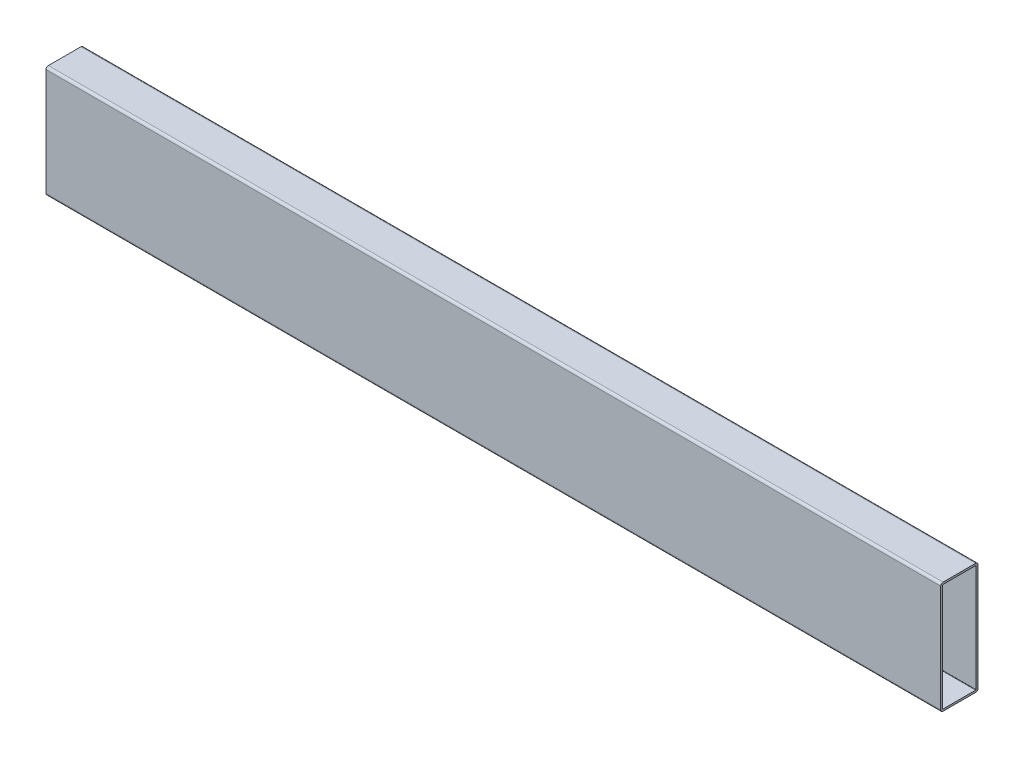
ISO-10303-21;
HEADER;
FILE_DESCRIPTION(('STEP AP214'),'2;1');
FILE_NAME('part.step','',(''),(''),'','','');
FILE_SCHEMA(('AUTOMOTIVE_DESIGN { 1 0 10303 214 1 1 1 1 }'));
ENDSEC;
DATA;
#1=APPLICATION_CONTEXT('core data for automotive mechanical design processes');
#2=APPLICATION_PROTOCOL_DEFINITION('international standard','automotive_design',2000,#1);
#3=PRODUCT_CONTEXT('',#1,'mechanical');
#4=PRODUCT('Part','Part','',(#3));
#5=PRODUCT_RELATED_PRODUCT_CATEGORY('part','',(#4));
#6=PRODUCT_DEFINITION_FORMATION('','',#4);
#7=PRODUCT_DEFINITION_CONTEXT('part definition',#1,'design');
#8=PRODUCT_DEFINITION('design','',#6,#7);
#9=PRODUCT_DEFINITION_SHAPE('','',#8);
#10=(LENGTH_UNIT() NAMED_UNIT(*) SI_UNIT(.MILLI.,.METRE.));
#11=(NAMED_UNIT(*) PLANE_ANGLE_UNIT() SI_UNIT($,.RADIAN.));
#12=(NAMED_UNIT(*) SI_UNIT($,.STERADIAN.) SOLID_ANGLE_UNIT());
#13=UNCERTAINTY_MEASURE_WITH_UNIT(LENGTH_MEASURE(1.E-05),#10,'distance_accuracy_value','');
#14=(GEOMETRIC_REPRESENTATION_CONTEXT(3) GLOBAL_UNCERTAINTY_ASSIGNED_CONTEXT((#13)) GLOBAL_UNIT_ASSIGNED_CONTEXT((#10,
#11,#12)) REPRESENTATION_CONTEXT('',''));
#15=CARTESIAN_POINT('',(0.,0.,0.));
#16=DIRECTION('',(0.,0.,1.));
#17=DIRECTION('',(1.,0.,0.));
#18=AXIS2_PLACEMENT_3D('',#15,#16,#17);
#19=CARTESIAN_POINT('',(609.6,3.65674086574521,-16.8519621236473));
#20=DIRECTION('',(-1.,0.,0.));
#21=DIRECTION('',(0.,0.,1.));
#22=AXIS2_PLACEMENT_3D('',#19,#20,#21);
#23=PLANE('',#22);
#24=CARTESIAN_POINT('',(609.6,3.65674086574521,-16.8519621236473));
#25=DIRECTION('',(1.,0.,0.));
#26=DIRECTION('',(0.,0.,1.));
#27=AXIS2_PLACEMENT_3D('',#24,#25,#26);
#28=CIRCLE('',#27,1.5875);
#29=CARTESIAN_POINT('',(609.6,3.6567408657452,-18.4394621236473));
#30=VERTEX_POINT('',#29);
#31=CARTESIAN_POINT('',(609.6,5.24424086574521,-16.8519621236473));
#32=VERTEX_POINT('',#31);
#33=EDGE_CURVE('E211',#30,#32,#28,.T.);
#34=ORIENTED_EDGE('',*,*,#33,.T.);
#35=DIRECTION('',(0.,0.,1.));
#36=VECTOR('',#35,1.);
#37=CARTESIAN_POINT('',(609.6,5.24424086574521,5.37303787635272));
#38=LINE('',#37,#36);
#39=CARTESIAN_POINT('',(609.6,5.24424086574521,5.37303787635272));
#40=VERTEX_POINT('',#39);
#41=EDGE_CURVE('E214',#32,#40,#38,.T.);
#42=ORIENTED_EDGE('',*,*,#41,.T.);
#43=CARTESIAN_POINT('',(609.6,3.65674086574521,5.37303787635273));
#44=DIRECTION('',(1.,0.,0.));
#45=DIRECTION('',(0.,0.,1.));
#46=AXIS2_PLACEMENT_3D('',#43,#44,#45);
#47=CIRCLE('',#46,1.5875);
#48=CARTESIAN_POINT('',(609.6,3.6567408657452,6.96053787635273));
#49=VERTEX_POINT('',#48);
#50=EDGE_CURVE('E217',#40,#49,#47,.T.);
#51=ORIENTED_EDGE('',*,*,#50,.T.);
#52=DIRECTION('',(0.,-1.,0.));
#53=VECTOR('',#52,1.);
#54=CARTESIAN_POINT('',(609.6,3.6567408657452,6.96053787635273));
#55=LINE('',#54,#53);
#56=CARTESIAN_POINT('',(609.6,-69.3682591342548,6.96053787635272));
#57=VERTEX_POINT('',#56);
#58=EDGE_CURVE('E219',#49,#57,#55,.T.);
#59=ORIENTED_EDGE('',*,*,#58,.T.);
#60=CARTESIAN_POINT('',(609.6,-69.3682591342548,5.37303787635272));
#61=DIRECTION('',(1.,0.,0.));
#62=DIRECTION('',(0.,0.,1.));
#63=AXIS2_PLACEMENT_3D('',#60,#61,#62);
#64=CIRCLE('',#63,1.5875);
#65=CARTESIAN_POINT('',(609.6,-70.9557591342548,5.37303787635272));
#66=VERTEX_POINT('',#65);
#67=EDGE_CURVE('E221',#57,#66,#64,.T.);
#68=ORIENTED_EDGE('',*,*,#67,.T.);
#69=DIRECTION('',(0.,0.,-1.));
#70=VECTOR('',#69,1.);
#71=CARTESIAN_POINT('',(609.6,-70.9557591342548,5.37303787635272));
#72=LINE('',#71,#70);
#73=CARTESIAN_POINT('',(609.6,-70.9557591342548,-16.8519621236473));
#74=VERTEX_POINT('',#73);
#75=EDGE_CURVE('E223',#66,#74,#72,.T.);
#76=ORIENTED_EDGE('',*,*,#75,.T.);
#77=CARTESIAN_POINT('',(609.6,-69.3682591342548,-16.8519621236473));
#78=DIRECTION('',(1.,0.,0.));
#79=DIRECTION('',(0.,0.,1.));
#80=AXIS2_PLACEMENT_3D('',#77,#78,#79);
#81=CIRCLE('',#80,1.5875);
#82=CARTESIAN_POINT('',(609.6,-69.3682591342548,-18.4394621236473));
#83=VERTEX_POINT('',#82);
#84=EDGE_CURVE('E225',#74,#83,#81,.T.);
#85=ORIENTED_EDGE('',*,*,#84,.T.);
#86=DIRECTION('',(0.,1.,0.));
#87=VECTOR('',#86,1.);
#88=CARTESIAN_POINT('',(609.6,3.6567408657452,-18.4394621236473));
#89=LINE('',#88,#87);
#90=EDGE_CURVE('E227',#83,#30,#89,.T.);
#91=ORIENTED_EDGE('',*,*,#90,.T.);
#92=EDGE_LOOP('',(#34,#42,#51,#59,#68,#76,#85,#91));
#93=FACE_BOUND('',#92,.T.);
#94=CARTESIAN_POINT('',(609.6,3.65674086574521,5.37303787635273));
#95=DIRECTION('',(1.,0.,0.));
#96=DIRECTION('',(0.,0.,1.));
#97=AXIS2_PLACEMENT_3D('',#94,#95,#96);
#98=CIRCLE('',#97,0.2413);
#99=CARTESIAN_POINT('',(609.6,3.89804086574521,5.37303787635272));
#100=VERTEX_POINT('',#99);
#101=CARTESIAN_POINT('',(609.6,3.6567408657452,5.61433787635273));
#102=VERTEX_POINT('',#101);
#103=EDGE_CURVE('E146',#100,#102,#98,.T.);
#104=ORIENTED_EDGE('',*,*,#103,.F.);
#105=DIRECTION('',(0.,0.,1.));
#106=VECTOR('',#105,1.);
#107=CARTESIAN_POINT('',(609.6,3.89804086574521,5.37303787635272));
#108=LINE('',#107,#106);
#109=CARTESIAN_POINT('',(609.6,3.89804086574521,-16.8519621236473));
#110=VERTEX_POINT('',#109);
#111=EDGE_CURVE('E179',#110,#100,#108,.T.);
#112=ORIENTED_EDGE('',*,*,#111,.F.);
#113=CARTESIAN_POINT('',(609.6,3.65674086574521,-16.8519621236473));
#114=DIRECTION('',(1.,0.,0.));
#115=DIRECTION('',(0.,0.,1.));
#116=AXIS2_PLACEMENT_3D('',#113,#114,#115);
#117=CIRCLE('',#116,0.2413);
#118=CARTESIAN_POINT('',(609.6,3.65674086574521,-17.0932621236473));
#119=VERTEX_POINT('',#118);
#120=EDGE_CURVE('E177',#119,#110,#117,.T.);
#121=ORIENTED_EDGE('',*,*,#120,.F.);
#122=DIRECTION('',(0.,1.,0.));
#123=VECTOR('',#122,1.);
#124=CARTESIAN_POINT('',(609.6,3.65674086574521,-17.0932621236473));
#125=LINE('',#124,#123);
#126=CARTESIAN_POINT('',(609.6,-69.3682591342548,-17.0932621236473));
#127=VERTEX_POINT('',#126);
#128=EDGE_CURVE('E175',#127,#119,#125,.T.);
#129=ORIENTED_EDGE('',*,*,#128,.F.);
#130=CARTESIAN_POINT('',(609.6,-69.3682591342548,-16.8519621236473));
#131=DIRECTION('',(1.,0.,0.));
#132=DIRECTION('',(0.,0.,1.));
#133=AXIS2_PLACEMENT_3D('',#130,#131,#132);
#134=CIRCLE('',#133,0.2413);
#135=CARTESIAN_POINT('',(609.6,-69.6095591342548,-16.8519621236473));
#136=VERTEX_POINT('',#135);
#137=EDGE_CURVE('E173',#136,#127,#134,.T.);
#138=ORIENTED_EDGE('',*,*,#137,.F.);
#139=DIRECTION('',(0.,0.,-1.));
#140=VECTOR('',#139,1.);
#141=CARTESIAN_POINT('',(609.6,-69.6095591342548,5.37303787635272));
#142=LINE('',#141,#140);
#143=CARTESIAN_POINT('',(609.6,-69.6095591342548,5.37303787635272));
#144=VERTEX_POINT('',#143);
#145=EDGE_CURVE('E169',#144,#136,#142,.T.);
#146=ORIENTED_EDGE('',*,*,#145,.F.);
#147=CARTESIAN_POINT('',(609.6,-69.3682591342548,5.37303787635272));
#148=DIRECTION('',(1.,0.,0.));
#149=DIRECTION('',(0.,0.,1.));
#150=AXIS2_PLACEMENT_3D('',#147,#148,#149);
#151=CIRCLE('',#150,0.2413);
#152=CARTESIAN_POINT('',(609.6,-69.3682591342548,5.61433787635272));
#153=VERTEX_POINT('',#152);
#154=EDGE_CURVE('E167',#153,#144,#151,.T.);
#155=ORIENTED_EDGE('',*,*,#154,.F.);
#156=DIRECTION('',(0.,-1.,0.));
#157=VECTOR('',#156,1.);
#158=CARTESIAN_POINT('',(609.6,3.6567408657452,5.61433787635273));
#159=LINE('',#158,#157);
#160=EDGE_CURVE('E154',#102,#153,#159,.T.);
#161=ORIENTED_EDGE('',*,*,#160,.F.);
#162=EDGE_LOOP('',(#104,#112,#121,#129,#138,#146,#155,#161));
#163=FACE_BOUND('',#162,.T.);
#164=ADVANCED_FACE('F33',(#93,#163),#23,.F.);
#165=CARTESIAN_POINT('',(0.,3.65674086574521,-16.8519621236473));
#166=DIRECTION('',(-1.,0.,0.));
#167=DIRECTION('',(0.,0.,1.));
#168=AXIS2_PLACEMENT_3D('',#165,#166,#167);
#169=PLANE('',#168);
#170=CARTESIAN_POINT('',(0.,3.65674086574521,-16.8519621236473));
#171=DIRECTION('',(1.,0.,0.));
#172=DIRECTION('',(0.,0.,1.));
#173=AXIS2_PLACEMENT_3D('',#170,#171,#172);
#174=CIRCLE('',#173,1.5875);
#175=CARTESIAN_POINT('',(0.,3.6567408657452,-18.4394621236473));
#176=VERTEX_POINT('',#175);
#177=CARTESIAN_POINT('',(0.,5.24424086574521,-16.8519621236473));
#178=VERTEX_POINT('',#177);
#179=EDGE_CURVE('E162',#176,#178,#174,.T.);
#180=ORIENTED_EDGE('',*,*,#179,.F.);
#181=DIRECTION('',(0.,1.,0.));
#182=VECTOR('',#181,1.);
#183=CARTESIAN_POINT('',(0.,3.6567408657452,-18.4394621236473));
#184=LINE('',#183,#182);
#185=CARTESIAN_POINT('',(0.,-69.3682591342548,-18.4394621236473));
#186=VERTEX_POINT('',#185);
#187=EDGE_CURVE('E215',#186,#176,#184,.T.);
#188=ORIENTED_EDGE('',*,*,#187,.F.);
#189=CARTESIAN_POINT('',(0.,-69.3682591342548,-16.8519621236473));
#190=DIRECTION('',(1.,0.,0.));
#191=DIRECTION('',(0.,0.,1.));
#192=AXIS2_PLACEMENT_3D('',#189,#190,#191);
#193=CIRCLE('',#192,1.5875);
#194=CARTESIAN_POINT('',(0.,-70.9557591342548,-16.8519621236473));
#195=VERTEX_POINT('',#194);
#196=EDGE_CURVE('E242',#195,#186,#193,.T.);
#197=ORIENTED_EDGE('',*,*,#196,.F.);
#198=DIRECTION('',(0.,0.,-1.));
#199=VECTOR('',#198,1.);
#200=CARTESIAN_POINT('',(0.,-70.9557591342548,5.37303787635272));
#201=LINE('',#200,#199);
#202=CARTESIAN_POINT('',(0.,-70.9557591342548,5.37303787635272));
#203=VERTEX_POINT('',#202);
#204=EDGE_CURVE('E240',#203,#195,#201,.T.);
#205=ORIENTED_EDGE('',*,*,#204,.F.);
#206=CARTESIAN_POINT('',(0.,-69.3682591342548,5.37303787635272));
#207=DIRECTION('',(1.,0.,0.));
#208=DIRECTION('',(0.,0.,1.));
#209=AXIS2_PLACEMENT_3D('',#206,#207,#208);
#210=CIRCLE('',#209,1.5875);
#211=CARTESIAN_POINT('',(0.,-69.3682591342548,6.96053787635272));
#212=VERTEX_POINT('',#211);
#213=EDGE_CURVE('E238',#212,#203,#210,.T.);
#214=ORIENTED_EDGE('',*,*,#213,.F.);
#215=DIRECTION('',(0.,-1.,0.));
#216=VECTOR('',#215,1.);
#217=CARTESIAN_POINT('',(0.,3.6567408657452,6.96053787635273));
#218=LINE('',#217,#216);
#219=CARTESIAN_POINT('',(0.,3.6567408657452,6.96053787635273));
#220=VERTEX_POINT('',#219);
#221=EDGE_CURVE('E236',#220,#212,#218,.T.);
#222=ORIENTED_EDGE('',*,*,#221,.F.);
#223=CARTESIAN_POINT('',(0.,3.65674086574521,5.37303787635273));
#224=DIRECTION('',(1.,0.,0.));
#225=DIRECTION('',(0.,0.,1.));
#226=AXIS2_PLACEMENT_3D('',#223,#224,#225);
#227=CIRCLE('',#226,1.5875);
#228=CARTESIAN_POINT('',(0.,5.24424086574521,5.37303787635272));
#229=VERTEX_POINT('',#228);
#230=EDGE_CURVE('E234',#229,#220,#227,.T.);
#231=ORIENTED_EDGE('',*,*,#230,.F.);
#232=DIRECTION('',(0.,0.,1.));
#233=VECTOR('',#232,1.);
#234=CARTESIAN_POINT('',(0.,5.24424086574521,5.37303787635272));
#235=LINE('',#234,#233);
#236=EDGE_CURVE('E232',#178,#229,#235,.T.);
#237=ORIENTED_EDGE('',*,*,#236,.F.);
#238=EDGE_LOOP('',(#180,#188,#197,#205,#214,#222,#231,#237));
#239=FACE_BOUND('',#238,.T.);
#240=DIRECTION('',(0.,0.,1.));
#241=VECTOR('',#240,1.);
#242=CARTESIAN_POINT('',(0.,3.89804086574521,5.37303787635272));
#243=LINE('',#242,#241);
#244=CARTESIAN_POINT('',(0.,3.89804086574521,-16.8519621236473));
#245=VERTEX_POINT('',#244);
#246=CARTESIAN_POINT('',(0.,3.89804086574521,5.37303787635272));
#247=VERTEX_POINT('',#246);
#248=EDGE_CURVE('E155',#245,#247,#243,.T.);
#249=ORIENTED_EDGE('',*,*,#248,.T.);
#250=CARTESIAN_POINT('',(0.,3.65674086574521,5.37303787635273));
#251=DIRECTION('',(1.,0.,0.));
#252=DIRECTION('',(0.,0.,1.));
#253=AXIS2_PLACEMENT_3D('',#250,#251,#252);
#254=CIRCLE('',#253,0.2413);
#255=CARTESIAN_POINT('',(0.,3.6567408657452,5.61433787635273));
#256=VERTEX_POINT('',#255);
#257=EDGE_CURVE('E56',#247,#256,#254,.T.);
#258=ORIENTED_EDGE('',*,*,#257,.T.);
#259=DIRECTION('',(0.,-1.,0.));
#260=VECTOR('',#259,1.);
#261=CARTESIAN_POINT('',(0.,3.6567408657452,5.61433787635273));
#262=LINE('',#261,#260);
#263=CARTESIAN_POINT('',(0.,-69.3682591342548,5.61433787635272));
#264=VERTEX_POINT('',#263);
#265=EDGE_CURVE('E161',#256,#264,#262,.T.);
#266=ORIENTED_EDGE('',*,*,#265,.T.);
#267=CARTESIAN_POINT('',(0.,-69.3682591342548,5.37303787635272));
#268=DIRECTION('',(1.,0.,0.));
#269=DIRECTION('',(0.,0.,1.));
#270=AXIS2_PLACEMENT_3D('',#267,#268,#269);
#271=CIRCLE('',#270,0.2413);
#272=CARTESIAN_POINT('',(0.,-69.6095591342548,5.37303787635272));
#273=VERTEX_POINT('',#272);
#274=EDGE_CURVE('E183',#264,#273,#271,.T.);
#275=ORIENTED_EDGE('',*,*,#274,.T.);
#276=DIRECTION('',(0.,0.,-1.));
#277=VECTOR('',#276,1.);
#278=CARTESIAN_POINT('',(0.,-69.6095591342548,5.37303787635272));
#279=LINE('',#278,#277);
#280=CARTESIAN_POINT('',(0.,-69.6095591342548,-16.8519621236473));
#281=VERTEX_POINT('',#280);
#282=EDGE_CURVE('E186',#273,#281,#279,.T.);
#283=ORIENTED_EDGE('',*,*,#282,.T.);
#284=CARTESIAN_POINT('',(0.,-69.3682591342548,-16.8519621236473));
#285=DIRECTION('',(1.,0.,0.));
#286=DIRECTION('',(0.,0.,1.));
#287=AXIS2_PLACEMENT_3D('',#284,#285,#286);
#288=CIRCLE('',#287,0.2413);
#289=CARTESIAN_POINT('',(0.,-69.3682591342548,-17.0932621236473));
#290=VERTEX_POINT('',#289);
#291=EDGE_CURVE('E189',#281,#290,#288,.T.);
#292=ORIENTED_EDGE('',*,*,#291,.T.);
#293=DIRECTION('',(0.,1.,0.));
#294=VECTOR('',#293,1.);
#295=CARTESIAN_POINT('',(0.,3.65674086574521,-17.0932621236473));
#296=LINE('',#295,#294);
#297=CARTESIAN_POINT('',(0.,3.65674086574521,-17.0932621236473));
#298=VERTEX_POINT('',#297);
#299=EDGE_CURVE('E192',#290,#298,#296,.T.);
#300=ORIENTED_EDGE('',*,*,#299,.T.);
#301=CARTESIAN_POINT('',(0.,3.65674086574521,-16.8519621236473));
#302=DIRECTION('',(1.,0.,0.));
#303=DIRECTION('',(0.,0.,1.));
#304=AXIS2_PLACEMENT_3D('',#301,#302,#303);
#305=CIRCLE('',#304,0.2413);
#306=EDGE_CURVE('E195',#298,#245,#305,.T.);
#307=ORIENTED_EDGE('',*,*,#306,.T.);
#308=EDGE_LOOP('',(#249,#258,#266,#275,#283,#292,#300,#307));
#309=FACE_BOUND('',#308,.T.);
#310=ADVANCED_FACE('F272',(#239,#309),#169,.T.);
#311=CARTESIAN_POINT('',(609.6,3.65674086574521,-16.8519621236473));
#312=DIRECTION('',(-1.,0.,0.));
#313=DIRECTION('',(0.,0.,1.));
#314=AXIS2_PLACEMENT_3D('',#311,#312,#313);
#315=CYLINDRICAL_SURFACE('',#314,1.5875);
#316=ORIENTED_EDGE('',*,*,#179,.T.);
#317=DIRECTION('',(-1.,0.,0.));
#318=VECTOR('',#317,1.);
#319=CARTESIAN_POINT('',(609.6,5.24424086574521,-16.8519621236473));
#320=LINE('',#319,#318);
#321=EDGE_CURVE('E11',#32,#178,#320,.T.);
#322=ORIENTED_EDGE('',*,*,#321,.F.);
#323=ORIENTED_EDGE('',*,*,#33,.F.);
#324=DIRECTION('',(-1.,0.,0.));
#325=VECTOR('',#324,1.);
#326=CARTESIAN_POINT('',(609.6,3.6567408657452,-18.4394621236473));
#327=LINE('',#326,#325);
#328=EDGE_CURVE('E229',#30,#176,#327,.T.);
#329=ORIENTED_EDGE('',*,*,#328,.T.);
#330=EDGE_LOOP('',(#316,#322,#323,#329));
#331=FACE_BOUND('',#330,.T.);
#332=ADVANCED_FACE('F35',(#331),#315,.T.);
#333=CARTESIAN_POINT('',(609.6,5.24424086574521,5.37303787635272));
#334=DIRECTION('',(0.,-1.,0.));
#335=DIRECTION('',(0.,0.,-1.));
#336=AXIS2_PLACEMENT_3D('',#333,#334,#335);
#337=PLANE('',#336);
#338=ORIENTED_EDGE('',*,*,#236,.T.);
#339=DIRECTION('',(-1.,0.,0.));
#340=VECTOR('',#339,1.);
#341=CARTESIAN_POINT('',(609.6,5.24424086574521,5.37303787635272));
#342=LINE('',#341,#340);
#343=EDGE_CURVE('E41',#40,#229,#342,.T.);
#344=ORIENTED_EDGE('',*,*,#343,.F.);
#345=ORIENTED_EDGE('',*,*,#41,.F.);
#346=ORIENTED_EDGE('',*,*,#321,.T.);
#347=EDGE_LOOP('',(#338,#344,#345,#346));
#348=FACE_BOUND('',#347,.T.);
#349=ADVANCED_FACE('F289',(#348),#337,.F.);
#350=CARTESIAN_POINT('',(609.6,3.65674086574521,5.37303787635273));
#351=DIRECTION('',(-1.,0.,0.));
#352=DIRECTION('',(0.,0.,1.));
#353=AXIS2_PLACEMENT_3D('',#350,#351,#352);
#354=CYLINDRICAL_SURFACE('',#353,1.5875);
#355=ORIENTED_EDGE('',*,*,#230,.T.);
#356=DIRECTION('',(-1.,0.,0.));
#357=VECTOR('',#356,1.);
#358=CARTESIAN_POINT('',(609.6,3.6567408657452,6.96053787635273));
#359=LINE('',#358,#357);
#360=EDGE_CURVE('E259',#49,#220,#359,.T.);
#361=ORIENTED_EDGE('',*,*,#360,.F.);
#362=ORIENTED_EDGE('',*,*,#50,.F.);
#363=ORIENTED_EDGE('',*,*,#343,.T.);
#364=EDGE_LOOP('',(#355,#361,#362,#363));
#365=FACE_BOUND('',#364,.T.);
#366=ADVANCED_FACE('F266',(#365),#354,.T.);
#367=CARTESIAN_POINT('',(609.6,3.6567408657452,6.96053787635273));
#368=DIRECTION('',(0.,0.,-1.));
#369=DIRECTION('',(0.,1.,0.));
#370=AXIS2_PLACEMENT_3D('',#367,#368,#369);
#371=PLANE('',#370);
#372=ORIENTED_EDGE('',*,*,#221,.T.);
#373=DIRECTION('',(-1.,0.,0.));
#374=VECTOR('',#373,1.);
#375=CARTESIAN_POINT('',(609.6,-69.3682591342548,6.96053787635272));
#376=LINE('',#375,#374);
#377=EDGE_CURVE('E256',#57,#212,#376,.T.);
#378=ORIENTED_EDGE('',*,*,#377,.F.);
#379=ORIENTED_EDGE('',*,*,#58,.F.);
#380=ORIENTED_EDGE('',*,*,#360,.T.);
#381=EDGE_LOOP('',(#372,#378,#379,#380));
#382=FACE_BOUND('',#381,.T.);
#383=ADVANCED_FACE('F278',(#382),#371,.F.);
#384=CARTESIAN_POINT('',(609.6,-69.3682591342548,5.37303787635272));
#385=DIRECTION('',(-1.,0.,0.));
#386=DIRECTION('',(0.,0.,1.));
#387=AXIS2_PLACEMENT_3D('',#384,#385,#386);
#388=CYLINDRICAL_SURFACE('',#387,1.5875);
#389=ORIENTED_EDGE('',*,*,#213,.T.);
#390=DIRECTION('',(-1.,0.,0.));
#391=VECTOR('',#390,1.);
#392=CARTESIAN_POINT('',(609.6,-70.9557591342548,5.37303787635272));
#393=LINE('',#392,#391);
#394=EDGE_CURVE('E253',#66,#203,#393,.T.);
#395=ORIENTED_EDGE('',*,*,#394,.F.);
#396=ORIENTED_EDGE('',*,*,#67,.F.);
#397=ORIENTED_EDGE('',*,*,#377,.T.);
#398=EDGE_LOOP('',(#389,#395,#396,#397));
#399=FACE_BOUND('',#398,.T.);
#400=ADVANCED_FACE('F282',(#399),#388,.T.);
#401=CARTESIAN_POINT('',(609.6,-70.9557591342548,5.37303787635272));
#402=DIRECTION('',(0.,1.,0.));
#403=DIRECTION('',(0.,0.,1.));
#404=AXIS2_PLACEMENT_3D('',#401,#402,#403);
#405=PLANE('',#404);
#406=ORIENTED_EDGE('',*,*,#204,.T.);
#407=DIRECTION('',(-1.,0.,0.));
#408=VECTOR('',#407,1.);
#409=CARTESIAN_POINT('',(609.6,-70.9557591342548,-16.8519621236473));
#410=LINE('',#409,#408);
#411=EDGE_CURVE('E250',#74,#195,#410,.T.);
#412=ORIENTED_EDGE('',*,*,#411,.F.);
#413=ORIENTED_EDGE('',*,*,#75,.F.);
#414=ORIENTED_EDGE('',*,*,#394,.T.);
#415=EDGE_LOOP('',(#406,#412,#413,#414));
#416=FACE_BOUND('',#415,.T.);
#417=ADVANCED_FACE('F302',(#416),#405,.F.);
#418=CARTESIAN_POINT('',(609.6,-69.3682591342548,-16.8519621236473));
#419=DIRECTION('',(-1.,0.,0.));
#420=DIRECTION('',(0.,0.,1.));
#421=AXIS2_PLACEMENT_3D('',#418,#419,#420);
#422=CYLINDRICAL_SURFACE('',#421,1.5875);
#423=ORIENTED_EDGE('',*,*,#196,.T.);
#424=DIRECTION('',(-1.,0.,0.));
#425=VECTOR('',#424,1.);
#426=CARTESIAN_POINT('',(609.6,-69.3682591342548,-18.4394621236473));
#427=LINE('',#426,#425);
#428=EDGE_CURVE('E247',#83,#186,#427,.T.);
#429=ORIENTED_EDGE('',*,*,#428,.F.);
#430=ORIENTED_EDGE('',*,*,#84,.F.);
#431=ORIENTED_EDGE('',*,*,#411,.T.);
#432=EDGE_LOOP('',(#423,#429,#430,#431));
#433=FACE_BOUND('',#432,.T.);
#434=ADVANCED_FACE('F300',(#433),#422,.T.);
#435=CARTESIAN_POINT('',(609.6,3.6567408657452,-18.4394621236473));
#436=DIRECTION('',(0.,0.,1.));
#437=DIRECTION('',(0.,-1.,0.));
#438=AXIS2_PLACEMENT_3D('',#435,#436,#437);
#439=PLANE('',#438);
#440=ORIENTED_EDGE('',*,*,#187,.T.);
#441=ORIENTED_EDGE('',*,*,#328,.F.);
#442=ORIENTED_EDGE('',*,*,#90,.F.);
#443=ORIENTED_EDGE('',*,*,#428,.T.);
#444=EDGE_LOOP('',(#440,#441,#442,#443));
#445=FACE_BOUND('',#444,.T.);
#446=ADVANCED_FACE('F295',(#445),#439,.F.);
#447=CARTESIAN_POINT('',(609.6,3.65674086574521,5.37303787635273));
#448=DIRECTION('',(-1.,0.,0.));
#449=DIRECTION('',(0.,0.,1.));
#450=AXIS2_PLACEMENT_3D('',#447,#448,#449);
#451=CYLINDRICAL_SURFACE('',#450,0.2413);
#452=ORIENTED_EDGE('',*,*,#257,.F.);
#453=DIRECTION('',(-1.,0.,0.));
#454=VECTOR('',#453,1.);
#455=CARTESIAN_POINT('',(609.6,3.89804086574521,5.37303787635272));
#456=LINE('',#455,#454);
#457=EDGE_CURVE('E150',#100,#247,#456,.T.);
#458=ORIENTED_EDGE('',*,*,#457,.F.);
#459=ORIENTED_EDGE('',*,*,#103,.T.);
#460=DIRECTION('',(-1.,0.,0.));
#461=VECTOR('',#460,1.);
#462=CARTESIAN_POINT('',(609.6,3.6567408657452,5.61433787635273));
#463=LINE('',#462,#461);
#464=EDGE_CURVE('E149',#102,#256,#463,.T.);
#465=ORIENTED_EDGE('',*,*,#464,.T.);
#466=EDGE_LOOP('',(#452,#458,#459,#465));
#467=FACE_BOUND('',#466,.T.);
#468=ADVANCED_FACE('F148',(#467),#451,.F.);
#469=CARTESIAN_POINT('',(609.6,3.6567408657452,5.61433787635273));
#470=DIRECTION('',(0.,0.,-1.));
#471=DIRECTION('',(0.,1.,0.));
#472=AXIS2_PLACEMENT_3D('',#469,#470,#471);
#473=PLANE('',#472);
#474=ORIENTED_EDGE('',*,*,#265,.F.);
#475=ORIENTED_EDGE('',*,*,#464,.F.);
#476=ORIENTED_EDGE('',*,*,#160,.T.);
#477=DIRECTION('',(-1.,0.,0.));
#478=VECTOR('',#477,1.);
#479=CARTESIAN_POINT('',(609.6,-69.3682591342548,5.61433787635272));
#480=LINE('',#479,#478);
#481=EDGE_CURVE('E163',#153,#264,#480,.T.);
#482=ORIENTED_EDGE('',*,*,#481,.T.);
#483=EDGE_LOOP('',(#474,#475,#476,#482));
#484=FACE_BOUND('',#483,.T.);
#485=ADVANCED_FACE('F158',(#484),#473,.T.);
#486=CARTESIAN_POINT('',(609.6,-69.3682591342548,5.37303787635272));
#487=DIRECTION('',(-1.,0.,0.));
#488=DIRECTION('',(0.,0.,1.));
#489=AXIS2_PLACEMENT_3D('',#486,#487,#488);
#490=CYLINDRICAL_SURFACE('',#489,0.2413);
#491=ORIENTED_EDGE('',*,*,#274,.F.);
#492=ORIENTED_EDGE('',*,*,#481,.F.);
#493=ORIENTED_EDGE('',*,*,#154,.T.);
#494=DIRECTION('',(-1.,0.,0.));
#495=VECTOR('',#494,1.);
#496=CARTESIAN_POINT('',(609.6,-69.6095591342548,5.37303787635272));
#497=LINE('',#496,#495);
#498=EDGE_CURVE('E208',#144,#273,#497,.T.);
#499=ORIENTED_EDGE('',*,*,#498,.T.);
#500=EDGE_LOOP('',(#491,#492,#493,#499));
#501=FACE_BOUND('',#500,.T.);
#502=ADVANCED_FACE('F327',(#501),#490,.F.);
#503=CARTESIAN_POINT('',(609.6,-69.6095591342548,5.37303787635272));
#504=DIRECTION('',(0.,1.,0.));
#505=DIRECTION('',(0.,0.,1.));
#506=AXIS2_PLACEMENT_3D('',#503,#504,#505);
#507=PLANE('',#506);
#508=ORIENTED_EDGE('',*,*,#282,.F.);
#509=ORIENTED_EDGE('',*,*,#498,.F.);
#510=ORIENTED_EDGE('',*,*,#145,.T.);
#511=DIRECTION('',(-1.,0.,0.));
#512=VECTOR('',#511,1.);
#513=CARTESIAN_POINT('',(609.6,-69.6095591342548,-16.8519621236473));
#514=LINE('',#513,#512);
#515=EDGE_CURVE('E206',#136,#281,#514,.T.);
#516=ORIENTED_EDGE('',*,*,#515,.T.);
#517=EDGE_LOOP('',(#508,#509,#510,#516));
#518=FACE_BOUND('',#517,.T.);
#519=ADVANCED_FACE('F331',(#518),#507,.T.);
#520=CARTESIAN_POINT('',(609.6,-69.3682591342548,-16.8519621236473));
#521=DIRECTION('',(-1.,0.,0.));
#522=DIRECTION('',(0.,0.,1.));
#523=AXIS2_PLACEMENT_3D('',#520,#521,#522);
#524=CYLINDRICAL_SURFACE('',#523,0.2413);
#525=ORIENTED_EDGE('',*,*,#291,.F.);
#526=ORIENTED_EDGE('',*,*,#515,.F.);
#527=ORIENTED_EDGE('',*,*,#137,.T.);
#528=DIRECTION('',(-1.,0.,0.));
#529=VECTOR('',#528,1.);
#530=CARTESIAN_POINT('',(609.6,-69.3682591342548,-17.0932621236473));
#531=LINE('',#530,#529);
#532=EDGE_CURVE('E204',#127,#290,#531,.T.);
#533=ORIENTED_EDGE('',*,*,#532,.T.);
#534=EDGE_LOOP('',(#525,#526,#527,#533));
#535=FACE_BOUND('',#534,.T.);
#536=ADVANCED_FACE('F337',(#535),#524,.F.);
#537=CARTESIAN_POINT('',(609.6,3.65674086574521,-17.0932621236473));
#538=DIRECTION('',(0.,0.,1.));
#539=DIRECTION('',(0.,-1.,0.));
#540=AXIS2_PLACEMENT_3D('',#537,#538,#539);
#541=PLANE('',#540);
#542=ORIENTED_EDGE('',*,*,#299,.F.);
#543=ORIENTED_EDGE('',*,*,#532,.F.);
#544=ORIENTED_EDGE('',*,*,#128,.T.);
#545=DIRECTION('',(-1.,0.,0.));
#546=VECTOR('',#545,1.);
#547=CARTESIAN_POINT('',(609.6,3.65674086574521,-17.0932621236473));
#548=LINE('',#547,#546);
#549=EDGE_CURVE('E202',#119,#298,#548,.T.);
#550=ORIENTED_EDGE('',*,*,#549,.T.);
#551=EDGE_LOOP('',(#542,#543,#544,#550));
#552=FACE_BOUND('',#551,.T.);
#553=ADVANCED_FACE('F341',(#552),#541,.T.);
#554=CARTESIAN_POINT('',(609.6,3.65674086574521,-16.8519621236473));
#555=DIRECTION('',(-1.,0.,0.));
#556=DIRECTION('',(0.,0.,1.));
#557=AXIS2_PLACEMENT_3D('',#554,#555,#556);
#558=CYLINDRICAL_SURFACE('',#557,0.2413);
#559=ORIENTED_EDGE('',*,*,#306,.F.);
#560=ORIENTED_EDGE('',*,*,#549,.F.);
#561=ORIENTED_EDGE('',*,*,#120,.T.);
#562=DIRECTION('',(-1.,0.,0.));
#563=VECTOR('',#562,1.);
#564=CARTESIAN_POINT('',(609.6,3.89804086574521,-16.8519621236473));
#565=LINE('',#564,#563);
#566=EDGE_CURVE('E48',#110,#245,#565,.T.);
#567=ORIENTED_EDGE('',*,*,#566,.T.);
#568=EDGE_LOOP('',(#559,#560,#561,#567));
#569=FACE_BOUND('',#568,.T.);
#570=ADVANCED_FACE('F345',(#569),#558,.F.);
#571=CARTESIAN_POINT('',(609.6,3.89804086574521,5.37303787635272));
#572=DIRECTION('',(0.,-1.,0.));
#573=DIRECTION('',(0.,0.,-1.));
#574=AXIS2_PLACEMENT_3D('',#571,#572,#573);
#575=PLANE('',#574);
#576=ORIENTED_EDGE('',*,*,#248,.F.);
#577=ORIENTED_EDGE('',*,*,#566,.F.);
#578=ORIENTED_EDGE('',*,*,#111,.T.);
#579=ORIENTED_EDGE('',*,*,#457,.T.);
#580=EDGE_LOOP('',(#576,#577,#578,#579));
#581=FACE_BOUND('',#580,.T.);
#582=ADVANCED_FACE('F349',(#581),#575,.T.);
#583=CLOSED_SHELL('',(#164,#310,#332,#349,#366,#383,#400,#417,#434,#446,#468,#485,#502,#519,
#536,#553,#570,#582));
#584=MANIFOLD_SOLID_BREP('B2',#583);
#585=ADVANCED_BREP_SHAPE_REPRESENTATION('',(#18,#584),#14);
#586=SHAPE_DEFINITION_REPRESENTATION(#9,#585);
ENDSEC;
END-ISO-10303-21;
